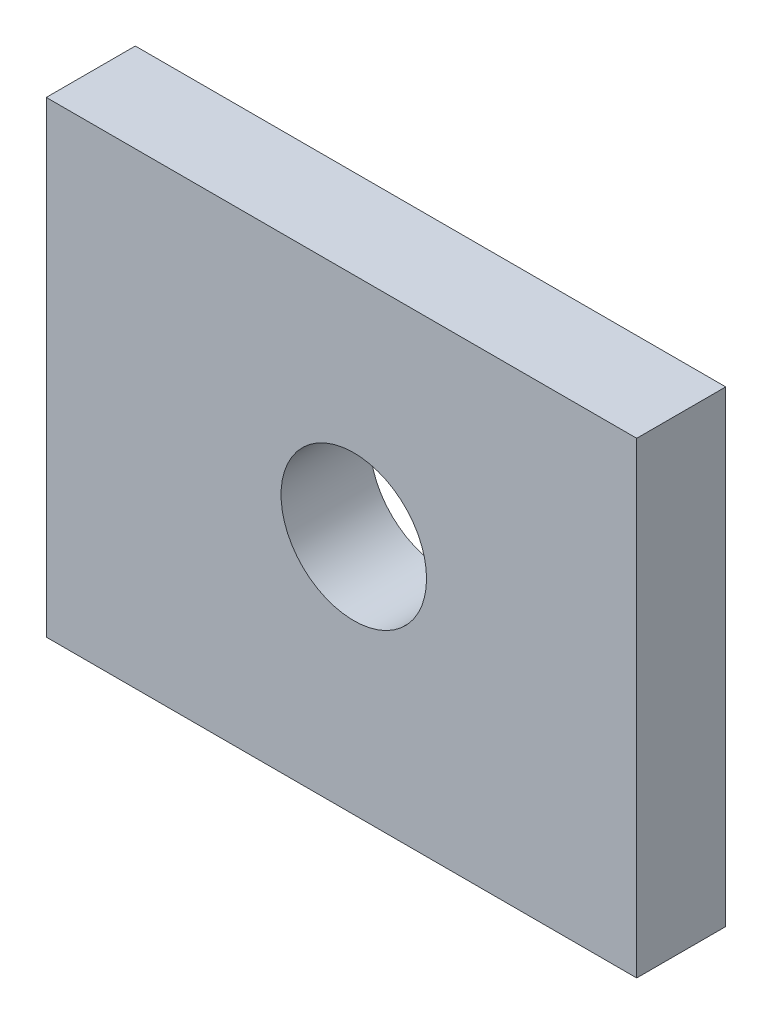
from build123d import *

# Parameters (mm, degrees)
SKETCH1_W          = 112.74427542
SKETCH1_H          = 89.255884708
EXTRUDE1_DEPTH     = 8.5
SKETCH2_R          = 13.89225242
CUT_EXTRUDE1_DEPTH = 77.487950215


with BuildPart() as part:
    # Sketch1 → Extrude1 (new, symmetric)
    with BuildSketch(Plane.XY):
        with Locations((-2.348839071, -1.342193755)):
            Rectangle(SKETCH1_W, SKETCH1_H)
    extrude(amount=EXTRUDE1_DEPTH, both=True)

    # Sketch2 → Cut-Extrude1 (cut, through all)
    with BuildSketch(Plane.XY.offset(8.5)):
        Circle(SKETCH2_R)
    extrude(amount=-CUT_EXTRUDE1_DEPTH, mode=Mode.SUBTRACT)


solid = part.part
